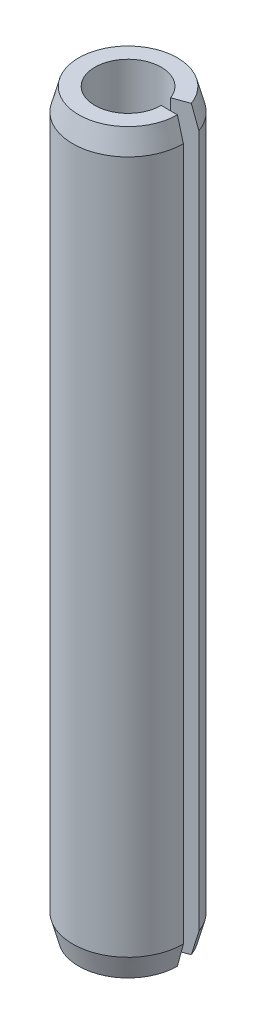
ISO-10303-21;
HEADER;
FILE_DESCRIPTION(('STEP AP214'),'2;1');
FILE_NAME('part.step','',(''),(''),'','','');
FILE_SCHEMA(('AUTOMOTIVE_DESIGN { 1 0 10303 214 1 1 1 1 }'));
ENDSEC;
DATA;
#1=APPLICATION_CONTEXT('core data for automotive mechanical design processes');
#2=APPLICATION_PROTOCOL_DEFINITION('international standard','automotive_design',2000,#1);
#3=PRODUCT_CONTEXT('',#1,'mechanical');
#4=PRODUCT('Part','Part','',(#3));
#5=PRODUCT_RELATED_PRODUCT_CATEGORY('part','',(#4));
#6=PRODUCT_DEFINITION_FORMATION('','',#4);
#7=PRODUCT_DEFINITION_CONTEXT('part definition',#1,'design');
#8=PRODUCT_DEFINITION('design','',#6,#7);
#9=PRODUCT_DEFINITION_SHAPE('','',#8);
#10=(LENGTH_UNIT() NAMED_UNIT(*) SI_UNIT(.MILLI.,.METRE.));
#11=(NAMED_UNIT(*) PLANE_ANGLE_UNIT() SI_UNIT($,.RADIAN.));
#12=(NAMED_UNIT(*) SI_UNIT($,.STERADIAN.) SOLID_ANGLE_UNIT());
#13=UNCERTAINTY_MEASURE_WITH_UNIT(LENGTH_MEASURE(1.E-05),#10,'distance_accuracy_value','');
#14=(GEOMETRIC_REPRESENTATION_CONTEXT(3) GLOBAL_UNCERTAINTY_ASSIGNED_CONTEXT((#13)) GLOBAL_UNIT_ASSIGNED_CONTEXT((#10,
#11,#12)) REPRESENTATION_CONTEXT('',''));
#15=CARTESIAN_POINT('',(0.,0.,0.));
#16=DIRECTION('',(0.,0.,1.));
#17=DIRECTION('',(1.,0.,0.));
#18=AXIS2_PLACEMENT_3D('',#15,#16,#17);
#19=CARTESIAN_POINT('',(0.,20.,0.));
#20=DIRECTION('',(0.,1.,0.));
#21=DIRECTION('',(-1.,0.,0.));
#22=AXIS2_PLACEMENT_3D('',#19,#20,#21);
#23=CYLINDRICAL_SURFACE('',#22,0.9);
#24=CARTESIAN_POINT('',(0.,20.,0.));
#25=DIRECTION('',(0.,1.,0.));
#26=DIRECTION('',(-1.,0.,0.));
#27=AXIS2_PLACEMENT_3D('',#24,#25,#26);
#28=CIRCLE('',#27,0.9);
#29=CARTESIAN_POINT('',(0.84572335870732,20.,-0.307818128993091));
#30=VERTEX_POINT('',#29);
#31=CARTESIAN_POINT('',(0.899999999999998,20.,0.));
#32=VERTEX_POINT('',#31);
#33=EDGE_CURVE('E11',#30,#32,#28,.T.);
#34=ORIENTED_EDGE('',*,*,#33,.T.);
#35=DIRECTION('',(0.,-1.,0.));
#36=VECTOR('',#35,1.);
#37=CARTESIAN_POINT('',(0.899999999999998,20.,0.));
#38=LINE('',#37,#36);
#39=CARTESIAN_POINT('',(0.900000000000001,0.,0.));
#40=VERTEX_POINT('',#39);
#41=EDGE_CURVE('E118',#32,#40,#38,.T.);
#42=ORIENTED_EDGE('',*,*,#41,.T.);
#43=CARTESIAN_POINT('',(0.,0.,0.));
#44=DIRECTION('',(0.,1.,0.));
#45=DIRECTION('',(-1.,0.,0.));
#46=AXIS2_PLACEMENT_3D('',#43,#44,#45);
#47=CIRCLE('',#46,0.900000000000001);
#48=CARTESIAN_POINT('',(0.845723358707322,0.,-0.307818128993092));
#49=VERTEX_POINT('',#48);
#50=EDGE_CURVE('E100',#49,#40,#47,.T.);
#51=ORIENTED_EDGE('',*,*,#50,.F.);
#52=DIRECTION('',(0.,-1.,0.));
#53=VECTOR('',#52,1.);
#54=CARTESIAN_POINT('',(0.84572335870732,20.,-0.307818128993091));
#55=LINE('',#54,#53);
#56=EDGE_CURVE('E138',#30,#49,#55,.T.);
#57=ORIENTED_EDGE('',*,*,#56,.F.);
#58=EDGE_LOOP('',(#34,#42,#51,#57));
#59=FACE_BOUND('',#58,.T.);
#60=ADVANCED_FACE('F41',(#59),#23,.F.);
#61=CARTESIAN_POINT('',(0.84572335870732,20.,-0.307818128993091));
#62=DIRECTION('',(0.,-1.,0.));
#63=DIRECTION('',(1.,0.,0.));
#64=AXIS2_PLACEMENT_3D('',#61,#62,#63);
#65=PLANE('',#64);
#66=CARTESIAN_POINT('',(0.,20.,0.));
#67=DIRECTION('',(0.,1.,0.));
#68=DIRECTION('',(-1.,0.,0.));
#69=AXIS2_PLACEMENT_3D('',#66,#67,#68);
#70=CIRCLE('',#69,1.33923048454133);
#71=CARTESIAN_POINT('',(1.25846500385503,20.,-0.458043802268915));
#72=VERTEX_POINT('',#71);
#73=CARTESIAN_POINT('',(1.33923048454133,20.,0.));
#74=VERTEX_POINT('',#73);
#75=EDGE_CURVE('E50',#72,#74,#70,.T.);
#76=ORIENTED_EDGE('',*,*,#75,.T.);
#77=DIRECTION('',(-1.,0.,0.));
#78=VECTOR('',#77,1.);
#79=CARTESIAN_POINT('',(0.899999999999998,20.,0.));
#80=LINE('',#79,#78);
#81=EDGE_CURVE('E135',#74,#32,#80,.T.);
#82=ORIENTED_EDGE('',*,*,#81,.T.);
#83=ORIENTED_EDGE('',*,*,#33,.F.);
#84=DIRECTION('',(-0.939692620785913,0.,0.342020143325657));
#85=VECTOR('',#84,1.);
#86=CARTESIAN_POINT('',(0.84572335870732,20.,-0.307818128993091));
#87=LINE('',#86,#85);
#88=EDGE_CURVE('E112',#72,#30,#87,.T.);
#89=ORIENTED_EDGE('',*,*,#88,.F.);
#90=EDGE_LOOP('',(#76,#82,#83,#89));
#91=FACE_BOUND('',#90,.T.);
#92=ADVANCED_FACE('F43',(#91),#65,.F.);
#93=CARTESIAN_POINT('',(0.,19.4,0.));
#94=DIRECTION('',(0.,-1.,0.));
#95=DIRECTION('',(1.,0.,0.));
#96=AXIS2_PLACEMENT_3D('',#93,#94,#95);
#97=CONICAL_SURFACE('',#96,1.5,0.261799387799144);
#98=CARTESIAN_POINT('',(0.,19.4,0.));
#99=DIRECTION('',(0.,1.,0.));
#100=DIRECTION('',(-1.,0.,0.));
#101=AXIS2_PLACEMENT_3D('',#98,#99,#100);
#102=CIRCLE('',#101,1.5);
#103=CARTESIAN_POINT('',(1.40953893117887,19.4,-0.513030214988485));
#104=VERTEX_POINT('',#103);
#105=CARTESIAN_POINT('',(1.5,19.4,0.));
#106=VERTEX_POINT('',#105);
#107=EDGE_CURVE('E156',#104,#106,#102,.T.);
#108=ORIENTED_EDGE('',*,*,#107,.T.);
#109=DIRECTION('',(-0.258819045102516,0.96592582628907,0.));
#110=VECTOR('',#109,1.);
#111=CARTESIAN_POINT('',(1.5,19.4,0.));
#112=LINE('',#111,#110);
#113=EDGE_CURVE('E132',#106,#74,#112,.T.);
#114=ORIENTED_EDGE('',*,*,#113,.T.);
#115=ORIENTED_EDGE('',*,*,#75,.F.);
#116=DIRECTION('',(-0.243210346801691,0.96592582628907,0.0885213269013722));
#117=VECTOR('',#116,1.);
#118=CARTESIAN_POINT('',(1.40953893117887,19.4,-0.513030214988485));
#119=LINE('',#118,#117);
#120=EDGE_CURVE('E148',#104,#72,#119,.T.);
#121=ORIENTED_EDGE('',*,*,#120,.F.);
#122=EDGE_LOOP('',(#108,#114,#115,#121));
#123=FACE_BOUND('',#122,.T.);
#124=ADVANCED_FACE('F160',(#123),#97,.T.);
#125=CARTESIAN_POINT('',(0.,20.,0.));
#126=DIRECTION('',(0.,1.,0.));
#127=DIRECTION('',(-1.,0.,0.));
#128=AXIS2_PLACEMENT_3D('',#125,#126,#127);
#129=CYLINDRICAL_SURFACE('',#128,1.5);
#130=CARTESIAN_POINT('',(0.,0.599999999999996,0.));
#131=DIRECTION('',(0.,1.,0.));
#132=DIRECTION('',(-1.,0.,0.));
#133=AXIS2_PLACEMENT_3D('',#130,#131,#132);
#134=CIRCLE('',#133,1.5);
#135=CARTESIAN_POINT('',(1.40953893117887,0.599999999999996,-0.513030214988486));
#136=VERTEX_POINT('',#135);
#137=CARTESIAN_POINT('',(1.5,0.599999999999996,0.));
#138=VERTEX_POINT('',#137);
#139=EDGE_CURVE('E154',#136,#138,#134,.T.);
#140=ORIENTED_EDGE('',*,*,#139,.T.);
#141=DIRECTION('',(0.,1.,0.));
#142=VECTOR('',#141,1.);
#143=CARTESIAN_POINT('',(1.5,19.4,0.));
#144=LINE('',#143,#142);
#145=EDGE_CURVE('E129',#138,#106,#144,.T.);
#146=ORIENTED_EDGE('',*,*,#145,.T.);
#147=ORIENTED_EDGE('',*,*,#107,.F.);
#148=DIRECTION('',(0.,1.,0.));
#149=VECTOR('',#148,1.);
#150=CARTESIAN_POINT('',(1.40953893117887,19.4,-0.513030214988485));
#151=LINE('',#150,#149);
#152=EDGE_CURVE('E144',#136,#104,#151,.T.);
#153=ORIENTED_EDGE('',*,*,#152,.F.);
#154=EDGE_LOOP('',(#140,#146,#147,#153));
#155=FACE_BOUND('',#154,.T.);
#156=ADVANCED_FACE('F162',(#155),#129,.T.);
#157=CARTESIAN_POINT('',(0.,0.,0.));
#158=DIRECTION('',(0.,1.,0.));
#159=DIRECTION('',(-1.,0.,0.));
#160=AXIS2_PLACEMENT_3D('',#157,#158,#159);
#161=CONICAL_SURFACE('',#160,1.33923048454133,0.261799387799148);
#162=CARTESIAN_POINT('',(0.,0.,0.));
#163=DIRECTION('',(0.,1.,0.));
#164=DIRECTION('',(-1.,0.,0.));
#165=AXIS2_PLACEMENT_3D('',#162,#163,#164);
#166=CIRCLE('',#165,1.33923048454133);
#167=CARTESIAN_POINT('',(1.25846500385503,0.,-0.458043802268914));
#168=VERTEX_POINT('',#167);
#169=CARTESIAN_POINT('',(1.33923048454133,0.,0.));
#170=VERTEX_POINT('',#169);
#171=EDGE_CURVE('E111',#168,#170,#166,.T.);
#172=ORIENTED_EDGE('',*,*,#171,.T.);
#173=DIRECTION('',(0.25881904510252,0.965925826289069,0.));
#174=VECTOR('',#173,1.);
#175=CARTESIAN_POINT('',(1.5,0.599999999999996,0.));
#176=LINE('',#175,#174);
#177=EDGE_CURVE('E121',#170,#138,#176,.T.);
#178=ORIENTED_EDGE('',*,*,#177,.T.);
#179=ORIENTED_EDGE('',*,*,#139,.F.);
#180=DIRECTION('',(0.243210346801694,0.965925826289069,-0.0885213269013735));
#181=VECTOR('',#180,1.);
#182=CARTESIAN_POINT('',(1.40953893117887,0.599999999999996,-0.513030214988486));
#183=LINE('',#182,#181);
#184=EDGE_CURVE('E141',#168,#136,#183,.T.);
#185=ORIENTED_EDGE('',*,*,#184,.F.);
#186=EDGE_LOOP('',(#172,#178,#179,#185));
#187=FACE_BOUND('',#186,.T.);
#188=ADVANCED_FACE('F166',(#187),#161,.T.);
#189=CARTESIAN_POINT('',(1.25846500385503,0.,-0.458043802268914));
#190=DIRECTION('',(0.,1.,0.));
#191=DIRECTION('',(-1.,0.,0.));
#192=AXIS2_PLACEMENT_3D('',#189,#190,#191);
#193=PLANE('',#192);
#194=DIRECTION('',(0.939692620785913,0.,-0.342020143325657));
#195=VECTOR('',#194,1.);
#196=CARTESIAN_POINT('',(1.25846500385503,0.,-0.458043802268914));
#197=LINE('',#196,#195);
#198=EDGE_CURVE('E106',#49,#168,#197,.T.);
#199=ORIENTED_EDGE('',*,*,#198,.F.);
#200=ORIENTED_EDGE('',*,*,#50,.T.);
#201=DIRECTION('',(1.,0.,0.));
#202=VECTOR('',#201,1.);
#203=CARTESIAN_POINT('',(1.33923048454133,0.,0.));
#204=LINE('',#203,#202);
#205=EDGE_CURVE('E103',#40,#170,#204,.T.);
#206=ORIENTED_EDGE('',*,*,#205,.T.);
#207=ORIENTED_EDGE('',*,*,#171,.F.);
#208=EDGE_LOOP('',(#199,#200,#206,#207));
#209=FACE_BOUND('',#208,.T.);
#210=ADVANCED_FACE('F102',(#209),#193,.F.);
#211=CARTESIAN_POINT('',(0.845723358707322,0.,-0.307818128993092));
#212=DIRECTION('',(-0.342020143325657,0.,-0.939692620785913));
#213=DIRECTION('',(-0.939692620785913,0.,0.342020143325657));
#214=AXIS2_PLACEMENT_3D('',#211,#212,#213);
#215=PLANE('',#214);
#216=ORIENTED_EDGE('',*,*,#56,.T.);
#217=ORIENTED_EDGE('',*,*,#198,.T.);
#218=ORIENTED_EDGE('',*,*,#184,.T.);
#219=ORIENTED_EDGE('',*,*,#152,.T.);
#220=ORIENTED_EDGE('',*,*,#120,.T.);
#221=ORIENTED_EDGE('',*,*,#88,.T.);
#222=EDGE_LOOP('',(#216,#217,#218,#219,#220,#221));
#223=FACE_BOUND('',#222,.T.);
#224=ADVANCED_FACE('F168',(#223),#215,.F.);
#225=CARTESIAN_POINT('',(0.900000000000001,0.,0.));
#226=DIRECTION('',(0.,0.,-1.));
#227=DIRECTION('',(-1.,0.,0.));
#228=AXIS2_PLACEMENT_3D('',#225,#226,#227);
#229=PLANE('',#228);
#230=ORIENTED_EDGE('',*,*,#41,.F.);
#231=ORIENTED_EDGE('',*,*,#81,.F.);
#232=ORIENTED_EDGE('',*,*,#113,.F.);
#233=ORIENTED_EDGE('',*,*,#145,.F.);
#234=ORIENTED_EDGE('',*,*,#177,.F.);
#235=ORIENTED_EDGE('',*,*,#205,.F.);
#236=EDGE_LOOP('',(#230,#231,#232,#233,#234,#235));
#237=FACE_BOUND('',#236,.T.);
#238=ADVANCED_FACE('F116',(#237),#229,.T.);
#239=CLOSED_SHELL('',(#60,#92,#124,#156,#188,#210,#224,#238));
#240=MANIFOLD_SOLID_BREP('B2',#239);
#241=ADVANCED_BREP_SHAPE_REPRESENTATION('',(#18,#240),#14);
#242=SHAPE_DEFINITION_REPRESENTATION(#9,#241);
ENDSEC;
END-ISO-10303-21;
